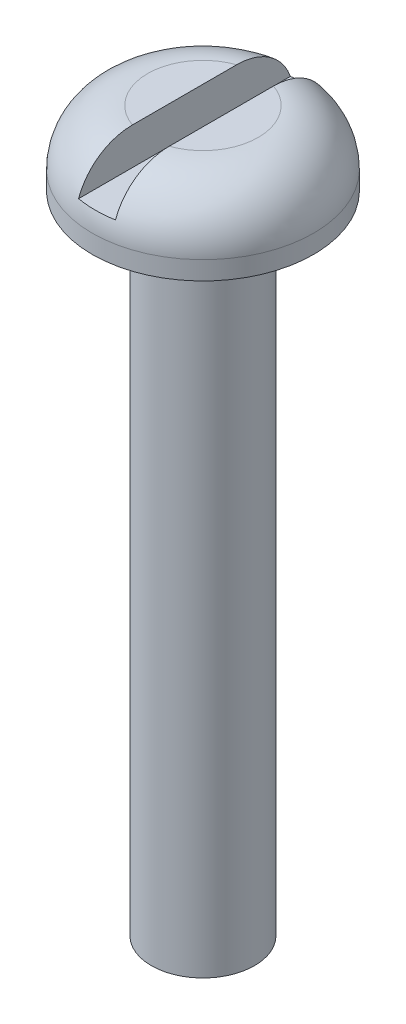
from build123d import *

# Parameters (mm, degrees)
ESQUISSE1_R             = 2.8
EXTRUSION1_DEPTH        = 35
ESQUISSE3_W             = 2
ESQUISSE3_H             = 2.355089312
ENL_V_MAT_EXTRU_1_DEPTH = 6.5


with BuildPart() as part:
    # Esquisse1 → Extrusion1 (new body)
    with BuildSketch(Plane(origin=(0, 6.4, 0), x_dir=(-1, 0, 0), z_dir=(0, 1, 0))):
        with Locations(Location((0, 0, 0), (0, 0, 90))):
            Circle(ESQUISSE1_R)
    extrude(amount=-EXTRUSION1_DEPTH)

    # Esquisse2 → R_volution1 (revolve)
    with BuildSketch(Plane.XY, mode=Mode.PRIVATE) as r_volution1_sk:
        with BuildLine():
            Line((-3, 10.4), (0, 10.4))
            Line((0, 10.4), (0, 6.4))
            Line((0, 6.4), (-6, 6.4))
            Line((-6, 6.4), (-6, 7.4))
            ThreePointArc((-6, 7.4), (-5.121320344, 9.521320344), (-3, 10.4))
        make_face()
    revolve(r_volution1_sk.sketch.rotate(Axis((0, 12, 0), (0, -1, 0)), 270), axis=Axis((0, 12, 0), (0, -1, 0)))

    # Esquisse3 → Enl_v. mat.-Extru.1 (cut, symmetric)
    with BuildSketch(Plane.XY):
        with Locations((0, 9.572737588)):
            Rectangle(ESQUISSE3_W, ESQUISSE3_H)
    extrude(amount=ENL_V_MAT_EXTRU_1_DEPTH, both=True, mode=Mode.SUBTRACT)


solid = part.part
